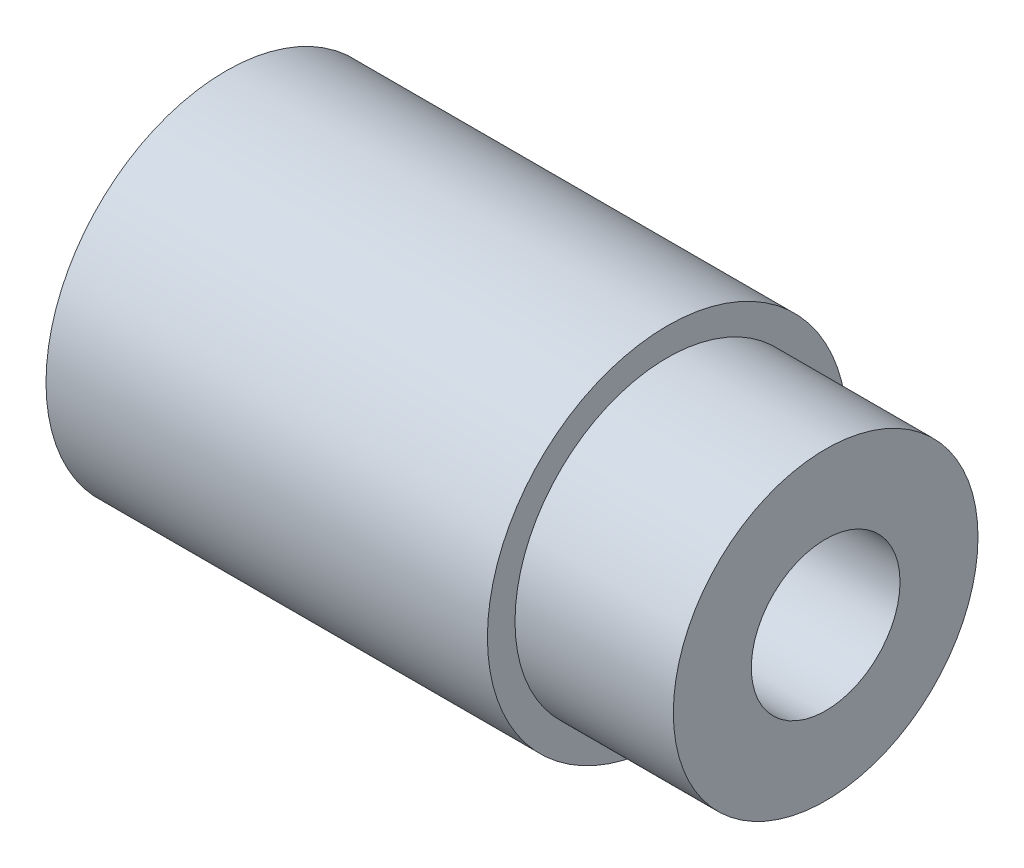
from build123d import *

# Parameters (mm, degrees)
ESQUISSE1_R         = 7.5
L_BASCULEURS_DEPTH  = 25
ESQUISSE2_OUTSIDE_W = 23.558
ESQUISSE2_OUTSIDE_H = 23.558
ESQUISSE2_OUTSIDE_R = 6.35
L_CORPS_AMORT_DEPTH = 6.6
ESQUISSE3_R         = 3.1
PASSAGE_VIS_DEPTH   = 28.156951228


with BuildPart() as part:
    # Esquisse1 → L_Basculeurs (new body)
    with BuildSketch(Plane(origin=(0, 0, 0), x_dir=(0, 0, -1), z_dir=(1, 0, 0))):
        Circle(ESQUISSE1_R)
    extrude(amount=-L_BASCULEURS_DEPTH)

    # Esquisse2 outside → L_Corps-Amort (cut)
    with BuildSketch(Plane(origin=(0, 0, 0), x_dir=(0, 0, -1), z_dir=(1, 0, 0))):
        Rectangle(ESQUISSE2_OUTSIDE_W, ESQUISSE2_OUTSIDE_H)
        Circle(ESQUISSE2_OUTSIDE_R, mode=Mode.SUBTRACT)
    extrude(amount=-L_CORPS_AMORT_DEPTH, mode=Mode.SUBTRACT)

    # Esquisse3 → Passage_Vis (cut, through all)
    with BuildSketch(Plane(origin=(0, 0, 0), x_dir=(0, 0, -1), z_dir=(1, 0, 0))):
        Circle(ESQUISSE3_R)
    extrude(amount=-PASSAGE_VIS_DEPTH, mode=Mode.SUBTRACT)


solid = part.part
